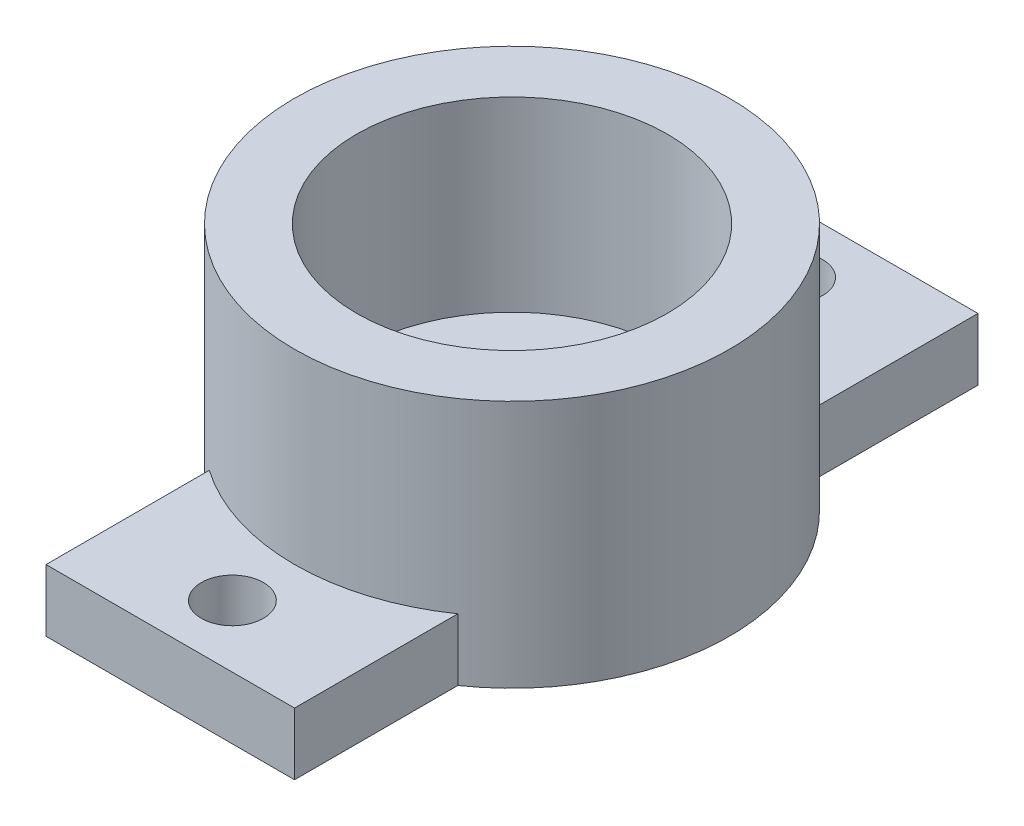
from build123d import *

# Parameters (mm, degrees)
SKETCH1_R           = 3.5
SKETCH1_R_2         = 2.5
BOSS_EXTRUDE1_DEPTH = 4
SKETCH2_R           = 2.5
BOSS_EXTRUDE2_DEPTH = 1
SKETCH3_R           = 0.5
CUT_EXTRUDE1_DEPTH  = 10.669539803
CUT_EXTRUDE2_START  = -10
CUT_EXTRUDE2_DEPTH  = 10


with BuildPart() as part:
    # Sketch1 → Boss-Extrude1 (new body)
    with BuildSketch(Plane(origin=(0, 0, 0), x_dir=(1, 0, 0), z_dir=(0, 1, 0))):
        with Locations(Location((0, 0, 0), (0, 0, 270))):
            Circle(SKETCH1_R)
        with Locations(Location((0, 0, 0), (0, 0, 270))):
            Circle(SKETCH1_R_2, mode=Mode.SUBTRACT)
    extrude(amount=BOSS_EXTRUDE1_DEPTH)

    # Sketch2 → Boss-Extrude2 (add)
    with BuildSketch(Plane(origin=(0, 0, 0), x_dir=(1, 0, 0), z_dir=(0, 1, 0))):
        with Locations(Location((0, 0, 0), (0, 0, 270))):
            Circle(SKETCH2_R)
        with BuildLine():
            Line((-2, 2.872281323), (-2, 6.5))
            ThreePointArc((-2, 6.5), (0, 8.5), (2, 6.5))
            Line((2, 6.5), (2, 2.872281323))
            ThreePointArc((2, 2.872281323), (0, 3.5), (-2, 2.872281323))
        make_face()
        with BuildLine():
            Line((2, -6.5), (2, -2.872281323))
            ThreePointArc((2, -2.872281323), (0, -3.5), (-2, -2.872281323))
            Line((-2, -2.872281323), (-2, -6.5))
            ThreePointArc((-2, -6.5), (0, -8.5), (2, -6.5))
        make_face()
    extrude(amount=BOSS_EXTRUDE2_DEPTH)

    # Sketch3 → Cut-Extrude1 (cut, through all)
    with BuildSketch(Plane(origin=(0, 1, 0), x_dir=(1, 0, 0), z_dir=(0, 1, 0))):
        with Locations(Location((0, 6.5, 0), (0, 0, 270))):
            Circle(SKETCH3_R)
        with Locations(Location((0, 4.5, 0), (0, 0, 270))):
            Circle(SKETCH3_R)
        with Locations(Location((0, -4.5, 0), (0, 0, 90))):
            Circle(SKETCH3_R)
        with Locations(Location((0, -6.5, 0), (0, 0, 90))):
            Circle(SKETCH3_R)
    extrude(amount=-CUT_EXTRUDE1_DEPTH, mode=Mode.SUBTRACT)

    # Sketch4 → Cut-Extrude2 (cut)
    with BuildSketch(Plane(origin=(0, 1, 0), x_dir=(1, 0, 0), z_dir=(0, 1, 0)).offset(CUT_EXTRUDE2_START)):
        with BuildLine():
            Line((-2, 5.5), (2, 5.5))
            Line((2, 5.5), (2, 6.5))
            ThreePointArc((2, 6.5), (0, 8.5), (-2, 6.5))
            Line((-2, 6.5), (-2, 5.5))
        make_face()
        with BuildLine():
            Line((-2, -6.5), (-2, -5.5))
            Line((-2, -5.5), (2, -5.5))
            Line((2, -5.5), (2, -6.5))
            ThreePointArc((2, -6.5), (0, -8.5), (-2, -6.5))
        make_face()
    extrude(amount=CUT_EXTRUDE2_DEPTH, mode=Mode.SUBTRACT)


solid = part.part
